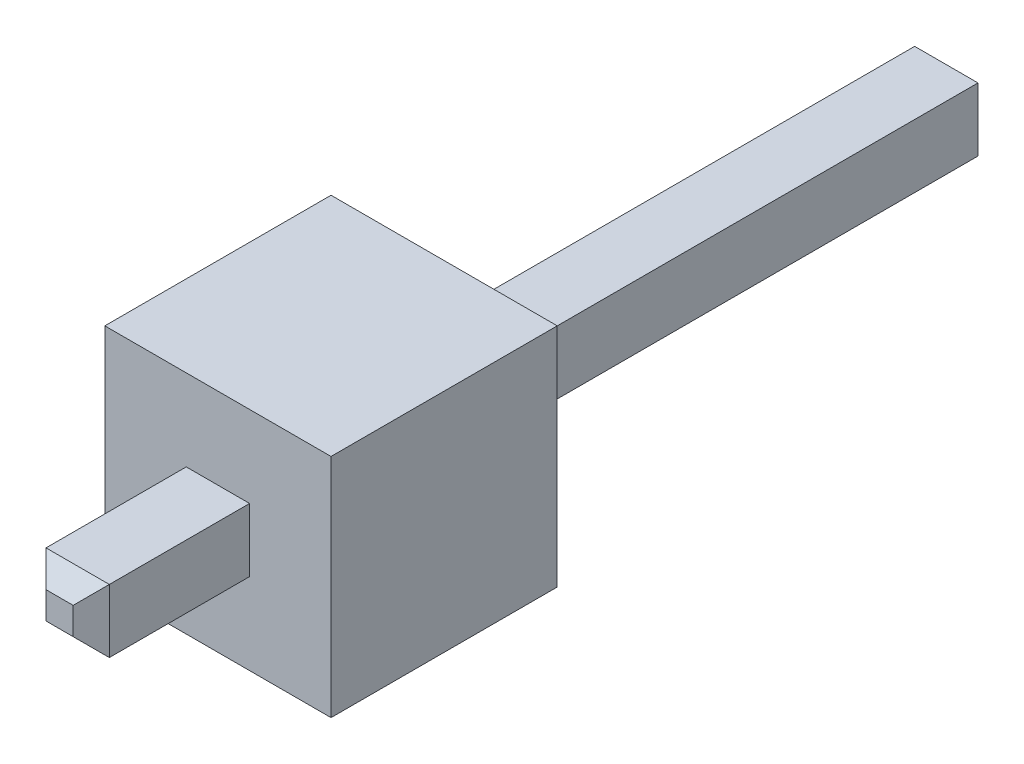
ISO-10303-21;
HEADER;
FILE_DESCRIPTION(('STEP AP214'),'2;1');
FILE_NAME('part.step','',(''),(''),'','','');
FILE_SCHEMA(('AUTOMOTIVE_DESIGN { 1 0 10303 214 1 1 1 1 }'));
ENDSEC;
DATA;
#1=APPLICATION_CONTEXT('core data for automotive mechanical design processes');
#2=APPLICATION_PROTOCOL_DEFINITION('international standard','automotive_design',2000,#1);
#3=PRODUCT_CONTEXT('',#1,'mechanical');
#4=PRODUCT('Part','Part','',(#3));
#5=PRODUCT_RELATED_PRODUCT_CATEGORY('part','',(#4));
#6=PRODUCT_DEFINITION_FORMATION('','',#4);
#7=PRODUCT_DEFINITION_CONTEXT('part definition',#1,'design');
#8=PRODUCT_DEFINITION('design','',#6,#7);
#9=PRODUCT_DEFINITION_SHAPE('','',#8);
#10=(LENGTH_UNIT() NAMED_UNIT(*) SI_UNIT(.MILLI.,.METRE.));
#11=(NAMED_UNIT(*) PLANE_ANGLE_UNIT() SI_UNIT($,.RADIAN.));
#12=(NAMED_UNIT(*) SI_UNIT($,.STERADIAN.) SOLID_ANGLE_UNIT());
#13=UNCERTAINTY_MEASURE_WITH_UNIT(LENGTH_MEASURE(1.E-05),#10,'distance_accuracy_value','');
#14=(GEOMETRIC_REPRESENTATION_CONTEXT(3) GLOBAL_UNCERTAINTY_ASSIGNED_CONTEXT((#13)) GLOBAL_UNIT_ASSIGNED_CONTEXT((#10,
#11,#12)) REPRESENTATION_CONTEXT('',''));
#15=CARTESIAN_POINT('',(0.,0.,0.));
#16=DIRECTION('',(0.,0.,1.));
#17=DIRECTION('',(1.,0.,0.));
#18=AXIS2_PLACEMENT_3D('',#15,#16,#17);
#19=CARTESIAN_POINT('',(0.3556,-0.3556,10.16));
#20=DIRECTION('',(-1.,0.,0.));
#21=DIRECTION('',(0.,0.,1.));
#22=AXIS2_PLACEMENT_3D('',#19,#20,#21);
#23=PLANE('',#22);
#24=DIRECTION('',(0.,0.,-1.));
#25=VECTOR('',#24,1.);
#26=CARTESIAN_POINT('',(0.3556,0.3556,10.16));
#27=LINE('',#26,#25);
#28=CARTESIAN_POINT('',(0.3556,0.3556,9.9568));
#29=VERTEX_POINT('',#28);
#30=CARTESIAN_POINT('',(0.3556,0.3556,8.382));
#31=VERTEX_POINT('',#30);
#32=EDGE_CURVE('E220',#29,#31,#27,.T.);
#33=ORIENTED_EDGE('',*,*,#32,.F.);
#34=DIRECTION('',(0.,-1.,0.));
#35=VECTOR('',#34,1.);
#36=CARTESIAN_POINT('',(0.3556,-0.3556,9.9568));
#37=LINE('',#36,#35);
#38=CARTESIAN_POINT('',(0.3556,-0.3556,9.9568));
#39=VERTEX_POINT('',#38);
#40=EDGE_CURVE('E242',#29,#39,#37,.T.);
#41=ORIENTED_EDGE('',*,*,#40,.T.);
#42=DIRECTION('',(0.,0.,-1.));
#43=VECTOR('',#42,1.);
#44=CARTESIAN_POINT('',(0.3556,-0.3556,10.16));
#45=LINE('',#44,#43);
#46=CARTESIAN_POINT('',(0.3556,-0.3556,8.382));
#47=VERTEX_POINT('',#46);
#48=EDGE_CURVE('E211',#39,#47,#45,.T.);
#49=ORIENTED_EDGE('',*,*,#48,.T.);
#50=DIRECTION('',(0.,-1.,0.));
#51=VECTOR('',#50,1.);
#52=CARTESIAN_POINT('',(0.3556,-0.3556,8.382));
#53=LINE('',#52,#51);
#54=EDGE_CURVE('E207',#31,#47,#53,.T.);
#55=ORIENTED_EDGE('',*,*,#54,.F.);
#56=EDGE_LOOP('',(#33,#41,#49,#55));
#57=FACE_BOUND('',#56,.T.);
#58=ADVANCED_FACE('F32',(#57),#23,.F.);
#59=CARTESIAN_POINT('',(-0.3556,0.3556,10.16));
#60=DIRECTION('',(0.,-1.,0.));
#61=DIRECTION('',(0.,0.,-1.));
#62=AXIS2_PLACEMENT_3D('',#59,#60,#61);
#63=PLANE('',#62);
#64=DIRECTION('',(0.,0.,-1.));
#65=VECTOR('',#64,1.);
#66=CARTESIAN_POINT('',(-0.3556,0.3556,10.16));
#67=LINE('',#66,#65);
#68=CARTESIAN_POINT('',(-0.3556,0.3556,9.9568));
#69=VERTEX_POINT('',#68);
#70=CARTESIAN_POINT('',(-0.3556,0.3556,8.382));
#71=VERTEX_POINT('',#70);
#72=EDGE_CURVE('E217',#69,#71,#67,.T.);
#73=ORIENTED_EDGE('',*,*,#72,.F.);
#74=DIRECTION('',(1.,0.,0.));
#75=VECTOR('',#74,1.);
#76=CARTESIAN_POINT('',(-0.3556,0.3556,9.9568));
#77=LINE('',#76,#75);
#78=EDGE_CURVE('E240',#69,#29,#77,.T.);
#79=ORIENTED_EDGE('',*,*,#78,.T.);
#80=ORIENTED_EDGE('',*,*,#32,.T.);
#81=DIRECTION('',(1.,0.,0.));
#82=VECTOR('',#81,1.);
#83=CARTESIAN_POINT('',(-0.3556,0.3556,8.382));
#84=LINE('',#83,#82);
#85=EDGE_CURVE('E204',#71,#31,#84,.T.);
#86=ORIENTED_EDGE('',*,*,#85,.F.);
#87=EDGE_LOOP('',(#73,#79,#80,#86));
#88=FACE_BOUND('',#87,.T.);
#89=ADVANCED_FACE('F316',(#88),#63,.F.);
#90=CARTESIAN_POINT('',(-0.3556,-0.3556,10.16));
#91=DIRECTION('',(1.,0.,0.));
#92=DIRECTION('',(0.,0.,-1.));
#93=AXIS2_PLACEMENT_3D('',#90,#91,#92);
#94=PLANE('',#93);
#95=DIRECTION('',(0.,0.,-1.));
#96=VECTOR('',#95,1.);
#97=CARTESIAN_POINT('',(-0.3556,-0.3556,10.16));
#98=LINE('',#97,#96);
#99=CARTESIAN_POINT('',(-0.3556,-0.3556,9.9568));
#100=VERTEX_POINT('',#99);
#101=CARTESIAN_POINT('',(-0.3556,-0.3556,8.382));
#102=VERTEX_POINT('',#101);
#103=EDGE_CURVE('E214',#100,#102,#98,.T.);
#104=ORIENTED_EDGE('',*,*,#103,.F.);
#105=DIRECTION('',(0.,1.,0.));
#106=VECTOR('',#105,1.);
#107=CARTESIAN_POINT('',(-0.3556,-0.3556,9.9568));
#108=LINE('',#107,#106);
#109=EDGE_CURVE('E237',#100,#69,#108,.T.);
#110=ORIENTED_EDGE('',*,*,#109,.T.);
#111=ORIENTED_EDGE('',*,*,#72,.T.);
#112=DIRECTION('',(0.,1.,0.));
#113=VECTOR('',#112,1.);
#114=CARTESIAN_POINT('',(-0.3556,-0.3556,8.382));
#115=LINE('',#114,#113);
#116=EDGE_CURVE('E201',#102,#71,#115,.T.);
#117=ORIENTED_EDGE('',*,*,#116,.F.);
#118=EDGE_LOOP('',(#104,#110,#111,#117));
#119=FACE_BOUND('',#118,.T.);
#120=ADVANCED_FACE('F323',(#119),#94,.F.);
#121=CARTESIAN_POINT('',(-0.3556,-0.3556,10.16));
#122=DIRECTION('',(0.,1.,0.));
#123=DIRECTION('',(0.,0.,1.));
#124=AXIS2_PLACEMENT_3D('',#121,#122,#123);
#125=PLANE('',#124);
#126=ORIENTED_EDGE('',*,*,#48,.F.);
#127=DIRECTION('',(-1.,0.,0.));
#128=VECTOR('',#127,1.);
#129=CARTESIAN_POINT('',(-0.3556,-0.3556,9.9568));
#130=LINE('',#129,#128);
#131=EDGE_CURVE('E244',#39,#100,#130,.T.);
#132=ORIENTED_EDGE('',*,*,#131,.T.);
#133=ORIENTED_EDGE('',*,*,#103,.T.);
#134=DIRECTION('',(-1.,0.,0.));
#135=VECTOR('',#134,1.);
#136=CARTESIAN_POINT('',(-0.3556,-0.3556,8.382));
#137=LINE('',#136,#135);
#138=EDGE_CURVE('E225',#47,#102,#137,.T.);
#139=ORIENTED_EDGE('',*,*,#138,.F.);
#140=EDGE_LOOP('',(#126,#132,#133,#139));
#141=FACE_BOUND('',#140,.T.);
#142=ADVANCED_FACE('F347',(#141),#125,.F.);
#143=CARTESIAN_POINT('',(0.,0.,10.16));
#144=DIRECTION('',(0.,0.,-1.));
#145=DIRECTION('',(-1.,0.,0.));
#146=AXIS2_PLACEMENT_3D('',#143,#144,#145);
#147=PLANE('',#146);
#148=DIRECTION('',(-1.,0.,0.));
#149=VECTOR('',#148,1.);
#150=CARTESIAN_POINT('',(0.,0.1524,10.16));
#151=LINE('',#150,#149);
#152=CARTESIAN_POINT('',(0.1524,0.1524,10.16));
#153=VERTEX_POINT('',#152);
#154=CARTESIAN_POINT('',(-0.1524,0.1524,10.16));
#155=VERTEX_POINT('',#154);
#156=EDGE_CURVE('E232',#153,#155,#151,.T.);
#157=ORIENTED_EDGE('',*,*,#156,.T.);
#158=DIRECTION('',(0.,-1.,0.));
#159=VECTOR('',#158,1.);
#160=CARTESIAN_POINT('',(-0.1524,0.,10.16));
#161=LINE('',#160,#159);
#162=CARTESIAN_POINT('',(-0.1524,-0.152399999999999,10.16));
#163=VERTEX_POINT('',#162);
#164=EDGE_CURVE('E234',#155,#163,#161,.T.);
#165=ORIENTED_EDGE('',*,*,#164,.T.);
#166=DIRECTION('',(1.,0.,0.));
#167=VECTOR('',#166,1.);
#168=CARTESIAN_POINT('',(0.,-0.152399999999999,10.16));
#169=LINE('',#168,#167);
#170=CARTESIAN_POINT('',(0.1524,-0.152399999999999,10.16));
#171=VERTEX_POINT('',#170);
#172=EDGE_CURVE('E228',#163,#171,#169,.T.);
#173=ORIENTED_EDGE('',*,*,#172,.T.);
#174=DIRECTION('',(0.,1.,0.));
#175=VECTOR('',#174,1.);
#176=CARTESIAN_POINT('',(0.1524,0.,10.16));
#177=LINE('',#176,#175);
#178=EDGE_CURVE('E230',#171,#153,#177,.T.);
#179=ORIENTED_EDGE('',*,*,#178,.T.);
#180=EDGE_LOOP('',(#157,#165,#173,#179));
#181=FACE_BOUND('',#180,.T.);
#182=ADVANCED_FACE('F340',(#181),#147,.F.);
#183=CARTESIAN_POINT('',(0.,0.,8.382));
#184=DIRECTION('',(0.,0.,-1.));
#185=DIRECTION('',(-1.,0.,0.));
#186=AXIS2_PLACEMENT_3D('',#183,#184,#185);
#187=PLANE('',#186);
#188=DIRECTION('',(0.,-1.,0.));
#189=VECTOR('',#188,1.);
#190=CARTESIAN_POINT('',(1.27,-1.27,8.382));
#191=LINE('',#190,#189);
#192=CARTESIAN_POINT('',(1.27,1.27,8.382));
#193=VERTEX_POINT('',#192);
#194=CARTESIAN_POINT('',(1.27,-1.27,8.382));
#195=VERTEX_POINT('',#194);
#196=EDGE_CURVE('E167',#193,#195,#191,.T.);
#197=ORIENTED_EDGE('',*,*,#196,.F.);
#198=DIRECTION('',(1.,0.,0.));
#199=VECTOR('',#198,1.);
#200=CARTESIAN_POINT('',(-1.27,1.27,8.382));
#201=LINE('',#200,#199);
#202=CARTESIAN_POINT('',(-1.27,1.27,8.382));
#203=VERTEX_POINT('',#202);
#204=EDGE_CURVE('E159',#203,#193,#201,.T.);
#205=ORIENTED_EDGE('',*,*,#204,.F.);
#206=DIRECTION('',(0.,1.,0.));
#207=VECTOR('',#206,1.);
#208=CARTESIAN_POINT('',(-1.27,-1.27,8.382));
#209=LINE('',#208,#207);
#210=CARTESIAN_POINT('',(-1.27,-1.27,8.382));
#211=VERTEX_POINT('',#210);
#212=EDGE_CURVE('E170',#211,#203,#209,.T.);
#213=ORIENTED_EDGE('',*,*,#212,.F.);
#214=DIRECTION('',(-1.,0.,0.));
#215=VECTOR('',#214,1.);
#216=CARTESIAN_POINT('',(-1.27,-1.27,8.382));
#217=LINE('',#216,#215);
#218=EDGE_CURVE('E151',#195,#211,#217,.T.);
#219=ORIENTED_EDGE('',*,*,#218,.F.);
#220=EDGE_LOOP('',(#197,#205,#213,#219));
#221=FACE_BOUND('',#220,.T.);
#222=ORIENTED_EDGE('',*,*,#85,.T.);
#223=ORIENTED_EDGE('',*,*,#54,.T.);
#224=ORIENTED_EDGE('',*,*,#138,.T.);
#225=ORIENTED_EDGE('',*,*,#116,.T.);
#226=EDGE_LOOP('',(#222,#223,#224,#225));
#227=FACE_BOUND('',#226,.T.);
#228=ADVANCED_FACE('F164',(#221,#227),#187,.F.);
#229=CARTESIAN_POINT('',(0.,0.,5.842));
#230=DIRECTION('',(0.,0.,-1.));
#231=DIRECTION('',(-1.,0.,0.));
#232=AXIS2_PLACEMENT_3D('',#229,#230,#231);
#233=PLANE('',#232);
#234=DIRECTION('',(0.,-1.,0.));
#235=VECTOR('',#234,1.);
#236=CARTESIAN_POINT('',(1.27,-1.27,5.842));
#237=LINE('',#236,#235);
#238=CARTESIAN_POINT('',(1.27,1.27,5.842));
#239=VERTEX_POINT('',#238);
#240=CARTESIAN_POINT('',(1.27,-1.27,5.842));
#241=VERTEX_POINT('',#240);
#242=EDGE_CURVE('E182',#239,#241,#237,.T.);
#243=ORIENTED_EDGE('',*,*,#242,.T.);
#244=DIRECTION('',(-1.,0.,0.));
#245=VECTOR('',#244,1.);
#246=CARTESIAN_POINT('',(-1.27,-1.27,5.842));
#247=LINE('',#246,#245);
#248=CARTESIAN_POINT('',(-1.27,-1.27,5.842));
#249=VERTEX_POINT('',#248);
#250=EDGE_CURVE('E153',#241,#249,#247,.T.);
#251=ORIENTED_EDGE('',*,*,#250,.T.);
#252=DIRECTION('',(0.,1.,0.));
#253=VECTOR('',#252,1.);
#254=CARTESIAN_POINT('',(-1.27,-1.27,5.842));
#255=LINE('',#254,#253);
#256=CARTESIAN_POINT('',(-1.27,1.27,5.842));
#257=VERTEX_POINT('',#256);
#258=EDGE_CURVE('E177',#249,#257,#255,.T.);
#259=ORIENTED_EDGE('',*,*,#258,.T.);
#260=DIRECTION('',(1.,0.,0.));
#261=VECTOR('',#260,1.);
#262=CARTESIAN_POINT('',(-1.27,1.27,5.842));
#263=LINE('',#262,#261);
#264=EDGE_CURVE('E174',#257,#239,#263,.T.);
#265=ORIENTED_EDGE('',*,*,#264,.T.);
#266=EDGE_LOOP('',(#243,#251,#259,#265));
#267=FACE_BOUND('',#266,.T.);
#268=DIRECTION('',(0.,-1.,0.));
#269=VECTOR('',#268,1.);
#270=CARTESIAN_POINT('',(0.3556,-0.3556,5.842));
#271=LINE('',#270,#269);
#272=CARTESIAN_POINT('',(0.3556,0.3556,5.842));
#273=VERTEX_POINT('',#272);
#274=CARTESIAN_POINT('',(0.3556,-0.3556,5.842));
#275=VERTEX_POINT('',#274);
#276=EDGE_CURVE('E198',#273,#275,#271,.T.);
#277=ORIENTED_EDGE('',*,*,#276,.F.);
#278=DIRECTION('',(1.,0.,0.));
#279=VECTOR('',#278,1.);
#280=CARTESIAN_POINT('',(-0.3556,0.3556,5.842));
#281=LINE('',#280,#279);
#282=CARTESIAN_POINT('',(-0.3556,0.3556,5.842));
#283=VERTEX_POINT('',#282);
#284=EDGE_CURVE('E195',#283,#273,#281,.T.);
#285=ORIENTED_EDGE('',*,*,#284,.F.);
#286=DIRECTION('',(0.,1.,0.));
#287=VECTOR('',#286,1.);
#288=CARTESIAN_POINT('',(-0.3556,-0.3556,5.842));
#289=LINE('',#288,#287);
#290=CARTESIAN_POINT('',(-0.3556,-0.3556,5.842));
#291=VERTEX_POINT('',#290);
#292=EDGE_CURVE('E189',#291,#283,#289,.T.);
#293=ORIENTED_EDGE('',*,*,#292,.F.);
#294=DIRECTION('',(-1.,0.,0.));
#295=VECTOR('',#294,1.);
#296=CARTESIAN_POINT('',(-0.3556,-0.3556,5.842));
#297=LINE('',#296,#295);
#298=EDGE_CURVE('E222',#275,#291,#297,.T.);
#299=ORIENTED_EDGE('',*,*,#298,.F.);
#300=EDGE_LOOP('',(#277,#285,#293,#299));
#301=FACE_BOUND('',#300,.T.);
#302=ADVANCED_FACE('F301',(#267,#301),#233,.T.);
#303=CARTESIAN_POINT('',(1.27,-1.27,8.382));
#304=DIRECTION('',(1.,0.,0.));
#305=DIRECTION('',(0.,0.,-1.));
#306=AXIS2_PLACEMENT_3D('',#303,#304,#305);
#307=PLANE('',#306);
#308=ORIENTED_EDGE('',*,*,#242,.F.);
#309=DIRECTION('',(0.,0.,-1.));
#310=VECTOR('',#309,1.);
#311=CARTESIAN_POINT('',(1.27,1.27,8.382));
#312=LINE('',#311,#310);
#313=EDGE_CURVE('E173',#193,#239,#312,.T.);
#314=ORIENTED_EDGE('',*,*,#313,.F.);
#315=ORIENTED_EDGE('',*,*,#196,.T.);
#316=DIRECTION('',(0.,0.,-1.));
#317=VECTOR('',#316,1.);
#318=CARTESIAN_POINT('',(1.27,-1.27,8.382));
#319=LINE('',#318,#317);
#320=EDGE_CURVE('E148',#195,#241,#319,.T.);
#321=ORIENTED_EDGE('',*,*,#320,.T.);
#322=EDGE_LOOP('',(#308,#314,#315,#321));
#323=FACE_BOUND('',#322,.T.);
#324=ADVANCED_FACE('F172',(#323),#307,.T.);
#325=CARTESIAN_POINT('',(-1.27,1.27,8.382));
#326=DIRECTION('',(0.,1.,0.));
#327=DIRECTION('',(0.,0.,1.));
#328=AXIS2_PLACEMENT_3D('',#325,#326,#327);
#329=PLANE('',#328);
#330=ORIENTED_EDGE('',*,*,#264,.F.);
#331=DIRECTION('',(0.,0.,-1.));
#332=VECTOR('',#331,1.);
#333=CARTESIAN_POINT('',(-1.27,1.27,8.382));
#334=LINE('',#333,#332);
#335=EDGE_CURVE('E190',#203,#257,#334,.T.);
#336=ORIENTED_EDGE('',*,*,#335,.F.);
#337=ORIENTED_EDGE('',*,*,#204,.T.);
#338=ORIENTED_EDGE('',*,*,#313,.T.);
#339=EDGE_LOOP('',(#330,#336,#337,#338));
#340=FACE_BOUND('',#339,.T.);
#341=ADVANCED_FACE('F425',(#340),#329,.T.);
#342=CARTESIAN_POINT('',(-1.27,-1.27,8.382));
#343=DIRECTION('',(-1.,0.,0.));
#344=DIRECTION('',(0.,0.,1.));
#345=AXIS2_PLACEMENT_3D('',#342,#343,#344);
#346=PLANE('',#345);
#347=ORIENTED_EDGE('',*,*,#258,.F.);
#348=DIRECTION('',(0.,0.,-1.));
#349=VECTOR('',#348,1.);
#350=CARTESIAN_POINT('',(-1.27,-1.27,8.382));
#351=LINE('',#350,#349);
#352=EDGE_CURVE('E158',#211,#249,#351,.T.);
#353=ORIENTED_EDGE('',*,*,#352,.F.);
#354=ORIENTED_EDGE('',*,*,#212,.T.);
#355=ORIENTED_EDGE('',*,*,#335,.T.);
#356=EDGE_LOOP('',(#347,#353,#354,#355));
#357=FACE_BOUND('',#356,.T.);
#358=ADVANCED_FACE('F417',(#357),#346,.T.);
#359=CARTESIAN_POINT('',(-1.27,-1.27,8.382));
#360=DIRECTION('',(0.,-1.,0.));
#361=DIRECTION('',(0.,0.,-1.));
#362=AXIS2_PLACEMENT_3D('',#359,#360,#361);
#363=PLANE('',#362);
#364=ORIENTED_EDGE('',*,*,#250,.F.);
#365=ORIENTED_EDGE('',*,*,#320,.F.);
#366=ORIENTED_EDGE('',*,*,#218,.T.);
#367=ORIENTED_EDGE('',*,*,#352,.T.);
#368=EDGE_LOOP('',(#364,#365,#366,#367));
#369=FACE_BOUND('',#368,.T.);
#370=ADVANCED_FACE('F150',(#369),#363,.T.);
#371=CARTESIAN_POINT('',(0.,0.,0.));
#372=DIRECTION('',(0.,0.,-1.));
#373=DIRECTION('',(-1.,0.,0.));
#374=AXIS2_PLACEMENT_3D('',#371,#372,#373);
#375=PLANE('',#374);
#376=DIRECTION('',(0.,1.,0.));
#377=VECTOR('',#376,1.);
#378=CARTESIAN_POINT('',(-0.1524,0.3556,0.));
#379=LINE('',#378,#377);
#380=CARTESIAN_POINT('',(-0.1524,-0.1524,0.));
#381=VERTEX_POINT('',#380);
#382=CARTESIAN_POINT('',(-0.1524,0.152400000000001,0.));
#383=VERTEX_POINT('',#382);
#384=EDGE_CURVE('E253',#381,#383,#379,.T.);
#385=ORIENTED_EDGE('',*,*,#384,.T.);
#386=DIRECTION('',(1.,0.,0.));
#387=VECTOR('',#386,1.);
#388=CARTESIAN_POINT('',(0.3556,0.152400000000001,0.));
#389=LINE('',#388,#387);
#390=CARTESIAN_POINT('',(0.1524,0.152400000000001,0.));
#391=VERTEX_POINT('',#390);
#392=EDGE_CURVE('E255',#383,#391,#389,.T.);
#393=ORIENTED_EDGE('',*,*,#392,.T.);
#394=DIRECTION('',(0.,-1.,0.));
#395=VECTOR('',#394,1.);
#396=CARTESIAN_POINT('',(0.1524,-0.3556,0.));
#397=LINE('',#396,#395);
#398=CARTESIAN_POINT('',(0.1524,-0.1524,0.));
#399=VERTEX_POINT('',#398);
#400=EDGE_CURVE('E249',#391,#399,#397,.T.);
#401=ORIENTED_EDGE('',*,*,#400,.T.);
#402=DIRECTION('',(-1.,0.,0.));
#403=VECTOR('',#402,1.);
#404=CARTESIAN_POINT('',(-0.3556,-0.1524,0.));
#405=LINE('',#404,#403);
#406=EDGE_CURVE('E251',#399,#381,#405,.T.);
#407=ORIENTED_EDGE('',*,*,#406,.T.);
#408=EDGE_LOOP('',(#385,#393,#401,#407));
#409=FACE_BOUND('',#408,.T.);
#410=ADVANCED_FACE('F287',(#409),#375,.T.);
#411=CARTESIAN_POINT('',(-0.3556,-0.3556,0.203200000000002));
#412=VERTEX_POINT('',#411);
#413=EDGE_CURVE('E213',#291,#412,#98,.T.);
#414=ORIENTED_EDGE('',*,*,#413,.T.);
#415=DIRECTION('',(1.,0.,0.));
#416=VECTOR('',#415,1.);
#417=CARTESIAN_POINT('',(0.3556,-0.3556,0.203200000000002));
#418=LINE('',#417,#416);
#419=CARTESIAN_POINT('',(0.3556,-0.3556,0.203200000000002));
#420=VERTEX_POINT('',#419);
#421=EDGE_CURVE('E41',#412,#420,#418,.T.);
#422=ORIENTED_EDGE('',*,*,#421,.T.);
#423=EDGE_CURVE('E210',#275,#420,#45,.T.);
#424=ORIENTED_EDGE('',*,*,#423,.F.);
#425=ORIENTED_EDGE('',*,*,#298,.T.);
#426=EDGE_LOOP('',(#414,#422,#424,#425));
#427=FACE_BOUND('',#426,.T.);
#428=ADVANCED_FACE('F302',(#427),#125,.F.);
#429=CARTESIAN_POINT('',(-0.3556,0.3556,0.203200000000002));
#430=VERTEX_POINT('',#429);
#431=EDGE_CURVE('E216',#283,#430,#67,.T.);
#432=ORIENTED_EDGE('',*,*,#431,.T.);
#433=DIRECTION('',(0.,-1.,0.));
#434=VECTOR('',#433,1.);
#435=CARTESIAN_POINT('',(-0.3556,-0.3556,0.203200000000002));
#436=LINE('',#435,#434);
#437=EDGE_CURVE('E56',#430,#412,#436,.T.);
#438=ORIENTED_EDGE('',*,*,#437,.T.);
#439=ORIENTED_EDGE('',*,*,#413,.F.);
#440=ORIENTED_EDGE('',*,*,#292,.T.);
#441=EDGE_LOOP('',(#432,#438,#439,#440));
#442=FACE_BOUND('',#441,.T.);
#443=ADVANCED_FACE('F299',(#442),#94,.F.);
#444=CARTESIAN_POINT('',(0.3556,0.3556,0.203200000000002));
#445=VERTEX_POINT('',#444);
#446=EDGE_CURVE('E219',#273,#445,#27,.T.);
#447=ORIENTED_EDGE('',*,*,#446,.T.);
#448=DIRECTION('',(-1.,0.,0.));
#449=VECTOR('',#448,1.);
#450=CARTESIAN_POINT('',(-0.3556,0.3556,0.203200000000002));
#451=LINE('',#450,#449);
#452=EDGE_CURVE('E246',#445,#430,#451,.T.);
#453=ORIENTED_EDGE('',*,*,#452,.T.);
#454=ORIENTED_EDGE('',*,*,#431,.F.);
#455=ORIENTED_EDGE('',*,*,#284,.T.);
#456=EDGE_LOOP('',(#447,#453,#454,#455));
#457=FACE_BOUND('',#456,.T.);
#458=ADVANCED_FACE('F297',(#457),#63,.F.);
#459=ORIENTED_EDGE('',*,*,#423,.T.);
#460=DIRECTION('',(0.,1.,0.));
#461=VECTOR('',#460,1.);
#462=CARTESIAN_POINT('',(0.3556,0.3556,0.203200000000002));
#463=LINE('',#462,#461);
#464=EDGE_CURVE('E11',#420,#445,#463,.T.);
#465=ORIENTED_EDGE('',*,*,#464,.T.);
#466=ORIENTED_EDGE('',*,*,#446,.F.);
#467=ORIENTED_EDGE('',*,*,#276,.T.);
#468=EDGE_LOOP('',(#459,#465,#466,#467));
#469=FACE_BOUND('',#468,.T.);
#470=ADVANCED_FACE('F304',(#469),#23,.F.);
#471=CARTESIAN_POINT('',(0.1524,0.,10.16));
#472=DIRECTION('',(-0.707106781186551,0.,-0.707106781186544));
#473=DIRECTION('',(0.,1.,0.));
#474=AXIS2_PLACEMENT_3D('',#471,#472,#473);
#475=PLANE('',#474);
#476=DIRECTION('',(-0.577350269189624,0.577350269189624,0.577350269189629));
#477=VECTOR('',#476,1.);
#478=CARTESIAN_POINT('',(0.1016,-0.1016,10.2108));
#479=LINE('',#478,#477);
#480=EDGE_CURVE('E264',#39,#171,#479,.T.);
#481=ORIENTED_EDGE('',*,*,#480,.F.);
#482=ORIENTED_EDGE('',*,*,#40,.F.);
#483=DIRECTION('',(-0.577350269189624,-0.577350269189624,0.577350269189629));
#484=VECTOR('',#483,1.);
#485=CARTESIAN_POINT('',(0.1016,0.1016,10.2108));
#486=LINE('',#485,#484);
#487=EDGE_CURVE('E184',#153,#29,#486,.F.);
#488=ORIENTED_EDGE('',*,*,#487,.F.);
#489=ORIENTED_EDGE('',*,*,#178,.F.);
#490=EDGE_LOOP('',(#481,#482,#488,#489));
#491=FACE_BOUND('',#490,.T.);
#492=ADVANCED_FACE('F306',(#491),#475,.F.);
#493=CARTESIAN_POINT('',(0.,0.1524,10.16));
#494=DIRECTION('',(0.,-0.707106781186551,-0.707106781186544));
#495=DIRECTION('',(-1.,0.,0.));
#496=AXIS2_PLACEMENT_3D('',#493,#494,#495);
#497=PLANE('',#496);
#498=ORIENTED_EDGE('',*,*,#487,.T.);
#499=ORIENTED_EDGE('',*,*,#78,.F.);
#500=DIRECTION('',(0.577350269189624,-0.577350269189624,0.577350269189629));
#501=VECTOR('',#500,1.);
#502=CARTESIAN_POINT('',(-0.1016,0.1016,10.2108));
#503=LINE('',#502,#501);
#504=EDGE_CURVE('E262',#155,#69,#503,.F.);
#505=ORIENTED_EDGE('',*,*,#504,.F.);
#506=ORIENTED_EDGE('',*,*,#156,.F.);
#507=EDGE_LOOP('',(#498,#499,#505,#506));
#508=FACE_BOUND('',#507,.T.);
#509=ADVANCED_FACE('F312',(#508),#497,.F.);
#510=CARTESIAN_POINT('',(0.,-0.152399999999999,10.16));
#511=DIRECTION('',(0.,0.707106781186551,-0.707106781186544));
#512=DIRECTION('',(1.,0.,0.));
#513=AXIS2_PLACEMENT_3D('',#510,#511,#512);
#514=PLANE('',#513);
#515=ORIENTED_EDGE('',*,*,#480,.T.);
#516=ORIENTED_EDGE('',*,*,#172,.F.);
#517=DIRECTION('',(-0.577350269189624,-0.577350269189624,-0.577350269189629));
#518=VECTOR('',#517,1.);
#519=CARTESIAN_POINT('',(-0.1016,-0.1016,10.2108));
#520=LINE('',#519,#518);
#521=EDGE_CURVE('E260',#100,#163,#520,.F.);
#522=ORIENTED_EDGE('',*,*,#521,.F.);
#523=ORIENTED_EDGE('',*,*,#131,.F.);
#524=EDGE_LOOP('',(#515,#516,#522,#523));
#525=FACE_BOUND('',#524,.T.);
#526=ADVANCED_FACE('F343',(#525),#514,.F.);
#527=CARTESIAN_POINT('',(-0.1524,0.,10.16));
#528=DIRECTION('',(0.707106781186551,0.,-0.707106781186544));
#529=DIRECTION('',(0.,-1.,0.));
#530=AXIS2_PLACEMENT_3D('',#527,#528,#529);
#531=PLANE('',#530);
#532=ORIENTED_EDGE('',*,*,#504,.T.);
#533=ORIENTED_EDGE('',*,*,#109,.F.);
#534=ORIENTED_EDGE('',*,*,#521,.T.);
#535=ORIENTED_EDGE('',*,*,#164,.F.);
#536=EDGE_LOOP('',(#532,#533,#534,#535));
#537=FACE_BOUND('',#536,.T.);
#538=ADVANCED_FACE('F354',(#537),#531,.F.);
#539=CARTESIAN_POINT('',(-0.3556,-0.3556,0.203200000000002));
#540=DIRECTION('',(0.,-0.707106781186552,-0.707106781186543));
#541=DIRECTION('',(-1.,0.,0.));
#542=AXIS2_PLACEMENT_3D('',#539,#540,#541);
#543=PLANE('',#542);
#544=DIRECTION('',(0.577350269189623,0.577350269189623,-0.577350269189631));
#545=VECTOR('',#544,1.);
#546=CARTESIAN_POINT('',(-0.3556,-0.3556,0.203200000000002));
#547=LINE('',#546,#545);
#548=EDGE_CURVE('E272',#381,#412,#547,.F.);
#549=ORIENTED_EDGE('',*,*,#548,.F.);
#550=ORIENTED_EDGE('',*,*,#406,.F.);
#551=DIRECTION('',(-0.577350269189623,0.577350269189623,-0.577350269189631));
#552=VECTOR('',#551,1.);
#553=CARTESIAN_POINT('',(0.3556,-0.3556,0.203200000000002));
#554=LINE('',#553,#552);
#555=EDGE_CURVE('E36',#420,#399,#554,.T.);
#556=ORIENTED_EDGE('',*,*,#555,.F.);
#557=ORIENTED_EDGE('',*,*,#421,.F.);
#558=EDGE_LOOP('',(#549,#550,#556,#557));
#559=FACE_BOUND('',#558,.T.);
#560=ADVANCED_FACE('F34',(#559),#543,.T.);
#561=CARTESIAN_POINT('',(0.3556,-0.3556,0.203200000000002));
#562=DIRECTION('',(0.707106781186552,0.,-0.707106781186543));
#563=DIRECTION('',(0.,-1.,0.));
#564=AXIS2_PLACEMENT_3D('',#561,#562,#563);
#565=PLANE('',#564);
#566=ORIENTED_EDGE('',*,*,#555,.T.);
#567=ORIENTED_EDGE('',*,*,#400,.F.);
#568=DIRECTION('',(0.577350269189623,0.577350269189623,0.577350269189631));
#569=VECTOR('',#568,1.);
#570=CARTESIAN_POINT('',(0.118533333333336,0.118533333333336,-0.0338666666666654));
#571=LINE('',#570,#569);
#572=EDGE_CURVE('E271',#445,#391,#571,.F.);
#573=ORIENTED_EDGE('',*,*,#572,.F.);
#574=ORIENTED_EDGE('',*,*,#464,.F.);
#575=EDGE_LOOP('',(#566,#567,#573,#574));
#576=FACE_BOUND('',#575,.T.);
#577=ADVANCED_FACE('F282',(#576),#565,.T.);
#578=CARTESIAN_POINT('',(-0.3556,-0.3556,0.203200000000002));
#579=DIRECTION('',(-0.707106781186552,0.,-0.707106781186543));
#580=DIRECTION('',(0.,1.,0.));
#581=AXIS2_PLACEMENT_3D('',#578,#579,#580);
#582=PLANE('',#581);
#583=ORIENTED_EDGE('',*,*,#548,.T.);
#584=ORIENTED_EDGE('',*,*,#437,.F.);
#585=DIRECTION('',(0.577350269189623,-0.577350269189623,-0.577350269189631));
#586=VECTOR('',#585,1.);
#587=CARTESIAN_POINT('',(-0.118533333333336,0.118533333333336,-0.0338666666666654));
#588=LINE('',#587,#586);
#589=EDGE_CURVE('E269',#383,#430,#588,.F.);
#590=ORIENTED_EDGE('',*,*,#589,.F.);
#591=ORIENTED_EDGE('',*,*,#384,.F.);
#592=EDGE_LOOP('',(#583,#584,#590,#591));
#593=FACE_BOUND('',#592,.T.);
#594=ADVANCED_FACE('F293',(#593),#582,.T.);
#595=CARTESIAN_POINT('',(-0.3556,0.3556,0.203200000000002));
#596=DIRECTION('',(0.,0.707106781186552,-0.707106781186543));
#597=DIRECTION('',(1.,0.,0.));
#598=AXIS2_PLACEMENT_3D('',#595,#596,#597);
#599=PLANE('',#598);
#600=ORIENTED_EDGE('',*,*,#572,.T.);
#601=ORIENTED_EDGE('',*,*,#392,.F.);
#602=ORIENTED_EDGE('',*,*,#589,.T.);
#603=ORIENTED_EDGE('',*,*,#452,.F.);
#604=EDGE_LOOP('',(#600,#601,#602,#603));
#605=FACE_BOUND('',#604,.T.);
#606=ADVANCED_FACE('F291',(#605),#599,.T.);
#607=CLOSED_SHELL('',(#58,#89,#120,#142,#182,#228,#302,#324,#341,#358,#370,#410,#428,#443,#458,
#470,#492,#509,#526,#538,#560,#577,#594,#606));
#608=MANIFOLD_SOLID_BREP('B2',#607);
#609=ADVANCED_BREP_SHAPE_REPRESENTATION('',(#18,#608),#14);
#610=SHAPE_DEFINITION_REPRESENTATION(#9,#609);
ENDSEC;
END-ISO-10303-21;
